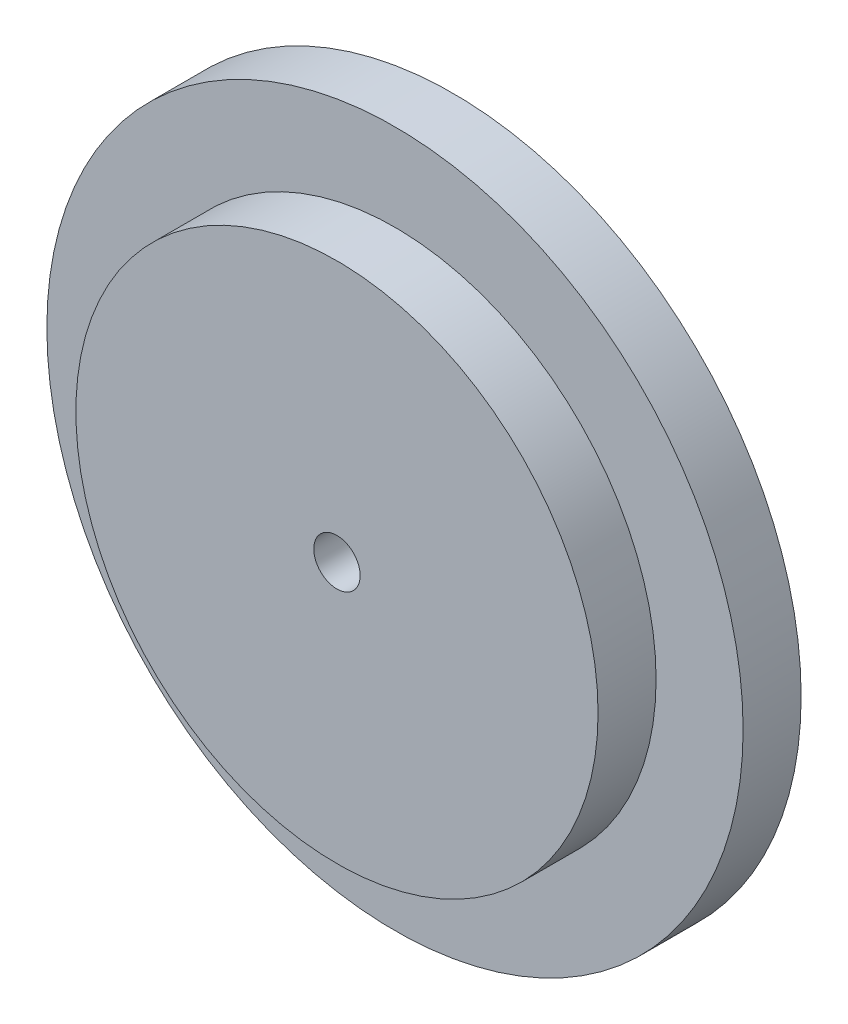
ISO-10303-21;
HEADER;
FILE_DESCRIPTION(('STEP AP214'),'2;1');
FILE_NAME('part.step','',(''),(''),'','','');
FILE_SCHEMA(('AUTOMOTIVE_DESIGN { 1 0 10303 214 1 1 1 1 }'));
ENDSEC;
DATA;
#1=APPLICATION_CONTEXT('core data for automotive mechanical design processes');
#2=APPLICATION_PROTOCOL_DEFINITION('international standard','automotive_design',2000,#1);
#3=PRODUCT_CONTEXT('',#1,'mechanical');
#4=PRODUCT('Part','Part','',(#3));
#5=PRODUCT_RELATED_PRODUCT_CATEGORY('part','',(#4));
#6=PRODUCT_DEFINITION_FORMATION('','',#4);
#7=PRODUCT_DEFINITION_CONTEXT('part definition',#1,'design');
#8=PRODUCT_DEFINITION('design','',#6,#7);
#9=PRODUCT_DEFINITION_SHAPE('','',#8);
#10=(LENGTH_UNIT() NAMED_UNIT(*) SI_UNIT(.MILLI.,.METRE.));
#11=(NAMED_UNIT(*) PLANE_ANGLE_UNIT() SI_UNIT($,.RADIAN.));
#12=(NAMED_UNIT(*) SI_UNIT($,.STERADIAN.) SOLID_ANGLE_UNIT());
#13=UNCERTAINTY_MEASURE_WITH_UNIT(LENGTH_MEASURE(1.E-05),#10,'distance_accuracy_value','');
#14=(GEOMETRIC_REPRESENTATION_CONTEXT(3) GLOBAL_UNCERTAINTY_ASSIGNED_CONTEXT((#13)) GLOBAL_UNIT_ASSIGNED_CONTEXT((#10,
#11,#12)) REPRESENTATION_CONTEXT('',''));
#15=CARTESIAN_POINT('',(0.,0.,0.));
#16=DIRECTION('',(0.,0.,1.));
#17=DIRECTION('',(1.,0.,0.));
#18=AXIS2_PLACEMENT_3D('',#15,#16,#17);
#19=CARTESIAN_POINT('',(0.,0.,6.35));
#20=DIRECTION('',(0.,0.,-1.));
#21=DIRECTION('',(-1.,0.,0.));
#22=AXIS2_PLACEMENT_3D('',#19,#20,#21);
#23=CYLINDRICAL_SURFACE('',#22,38.1);
#24=CARTESIAN_POINT('',(0.,0.,6.35));
#25=DIRECTION('',(0.,0.,1.));
#26=DIRECTION('',(1.,0.,0.));
#27=AXIS2_PLACEMENT_3D('',#24,#25,#26);
#28=CIRCLE('',#27,38.1);
#29=CARTESIAN_POINT('',(38.1,0.,6.35));
#30=VERTEX_POINT('',#29);
#31=EDGE_CURVE('E10',#30,#30,#28,.T.);
#32=ORIENTED_EDGE('',*,*,#31,.F.);
#33=EDGE_LOOP('',(#32));
#34=FACE_BOUND('',#33,.T.);
#35=CARTESIAN_POINT('',(0.,0.,0.));
#36=DIRECTION('',(0.,0.,1.));
#37=DIRECTION('',(1.,0.,0.));
#38=AXIS2_PLACEMENT_3D('',#35,#36,#37);
#39=CIRCLE('',#38,38.1);
#40=CARTESIAN_POINT('',(38.1,0.,0.));
#41=VERTEX_POINT('',#40);
#42=EDGE_CURVE('E33',#41,#41,#39,.T.);
#43=ORIENTED_EDGE('',*,*,#42,.T.);
#44=EDGE_LOOP('',(#43));
#45=FACE_BOUND('',#44,.T.);
#46=ADVANCED_FACE('F30',(#34,#45),#23,.T.);
#47=CARTESIAN_POINT('',(0.,0.,6.35));
#48=DIRECTION('',(0.,0.,1.));
#49=DIRECTION('',(1.,0.,0.));
#50=AXIS2_PLACEMENT_3D('',#47,#48,#49);
#51=PLANE('',#50);
#52=CARTESIAN_POINT('',(0.,0.,6.35));
#53=DIRECTION('',(0.,0.,1.));
#54=DIRECTION('',(1.,0.,0.));
#55=AXIS2_PLACEMENT_3D('',#52,#53,#54);
#56=CIRCLE('',#55,28.575);
#57=CARTESIAN_POINT('',(28.575,0.,6.35));
#58=VERTEX_POINT('',#57);
#59=EDGE_CURVE('E42',#58,#58,#56,.T.);
#60=ORIENTED_EDGE('',*,*,#59,.F.);
#61=EDGE_LOOP('',(#60));
#62=FACE_BOUND('',#61,.T.);
#63=ORIENTED_EDGE('',*,*,#31,.T.);
#64=EDGE_LOOP('',(#63));
#65=FACE_BOUND('',#64,.T.);
#66=ADVANCED_FACE('F75',(#62,#65),#51,.T.);
#67=CARTESIAN_POINT('',(0.,0.,0.));
#68=DIRECTION('',(0.,0.,1.));
#69=DIRECTION('',(1.,0.,0.));
#70=AXIS2_PLACEMENT_3D('',#67,#68,#69);
#71=PLANE('',#70);
#72=CARTESIAN_POINT('',(0.,0.,0.));
#73=DIRECTION('',(0.,0.,1.));
#74=DIRECTION('',(1.,0.,0.));
#75=AXIS2_PLACEMENT_3D('',#72,#73,#74);
#76=CIRCLE('',#75,2.54);
#77=CARTESIAN_POINT('',(2.54,0.,0.));
#78=VERTEX_POINT('',#77);
#79=EDGE_CURVE('E45',#78,#78,#76,.T.);
#80=ORIENTED_EDGE('',*,*,#79,.T.);
#81=EDGE_LOOP('',(#80));
#82=FACE_BOUND('',#81,.T.);
#83=ORIENTED_EDGE('',*,*,#42,.F.);
#84=EDGE_LOOP('',(#83));
#85=FACE_BOUND('',#84,.T.);
#86=ADVANCED_FACE('F54',(#82,#85),#71,.F.);
#87=CARTESIAN_POINT('',(0.,0.,12.7));
#88=DIRECTION('',(0.,0.,-1.));
#89=DIRECTION('',(-1.,0.,0.));
#90=AXIS2_PLACEMENT_3D('',#87,#88,#89);
#91=CYLINDRICAL_SURFACE('',#90,28.575);
#92=CARTESIAN_POINT('',(0.,0.,12.7));
#93=DIRECTION('',(0.,0.,1.));
#94=DIRECTION('',(1.,0.,0.));
#95=AXIS2_PLACEMENT_3D('',#92,#93,#94);
#96=CIRCLE('',#95,28.575);
#97=CARTESIAN_POINT('',(28.575,0.,12.7));
#98=VERTEX_POINT('',#97);
#99=EDGE_CURVE('E40',#98,#98,#96,.T.);
#100=ORIENTED_EDGE('',*,*,#99,.F.);
#101=EDGE_LOOP('',(#100));
#102=FACE_BOUND('',#101,.T.);
#103=ORIENTED_EDGE('',*,*,#59,.T.);
#104=EDGE_LOOP('',(#103));
#105=FACE_BOUND('',#104,.T.);
#106=ADVANCED_FACE('F66',(#102,#105),#91,.T.);
#107=CARTESIAN_POINT('',(0.,0.,12.7));
#108=DIRECTION('',(0.,0.,1.));
#109=DIRECTION('',(1.,0.,0.));
#110=AXIS2_PLACEMENT_3D('',#107,#108,#109);
#111=PLANE('',#110);
#112=CARTESIAN_POINT('',(0.,0.,12.7));
#113=DIRECTION('',(0.,0.,1.));
#114=DIRECTION('',(1.,0.,0.));
#115=AXIS2_PLACEMENT_3D('',#112,#113,#114);
#116=CIRCLE('',#115,2.54);
#117=CARTESIAN_POINT('',(2.54,0.,12.7));
#118=VERTEX_POINT('',#117);
#119=EDGE_CURVE('E48',#118,#118,#116,.T.);
#120=ORIENTED_EDGE('',*,*,#119,.F.);
#121=EDGE_LOOP('',(#120));
#122=FACE_BOUND('',#121,.T.);
#123=ORIENTED_EDGE('',*,*,#99,.T.);
#124=EDGE_LOOP('',(#123));
#125=FACE_BOUND('',#124,.T.);
#126=ADVANCED_FACE('F60',(#122,#125),#111,.T.);
#127=CARTESIAN_POINT('',(0.,0.,0.));
#128=DIRECTION('',(0.,0.,1.));
#129=DIRECTION('',(1.,0.,0.));
#130=AXIS2_PLACEMENT_3D('',#127,#128,#129);
#131=CYLINDRICAL_SURFACE('',#130,2.54);
#132=ORIENTED_EDGE('',*,*,#79,.F.);
#133=EDGE_LOOP('',(#132));
#134=FACE_BOUND('',#133,.T.);
#135=ORIENTED_EDGE('',*,*,#119,.T.);
#136=EDGE_LOOP('',(#135));
#137=FACE_BOUND('',#136,.T.);
#138=ADVANCED_FACE('F57',(#134,#137),#131,.F.);
#139=CLOSED_SHELL('',(#46,#66,#86,#106,#126,#138));
#140=MANIFOLD_SOLID_BREP('B2',#139);
#141=ADVANCED_BREP_SHAPE_REPRESENTATION('',(#18,#140),#14);
#142=SHAPE_DEFINITION_REPRESENTATION(#9,#141);
ENDSEC;
END-ISO-10303-21;
